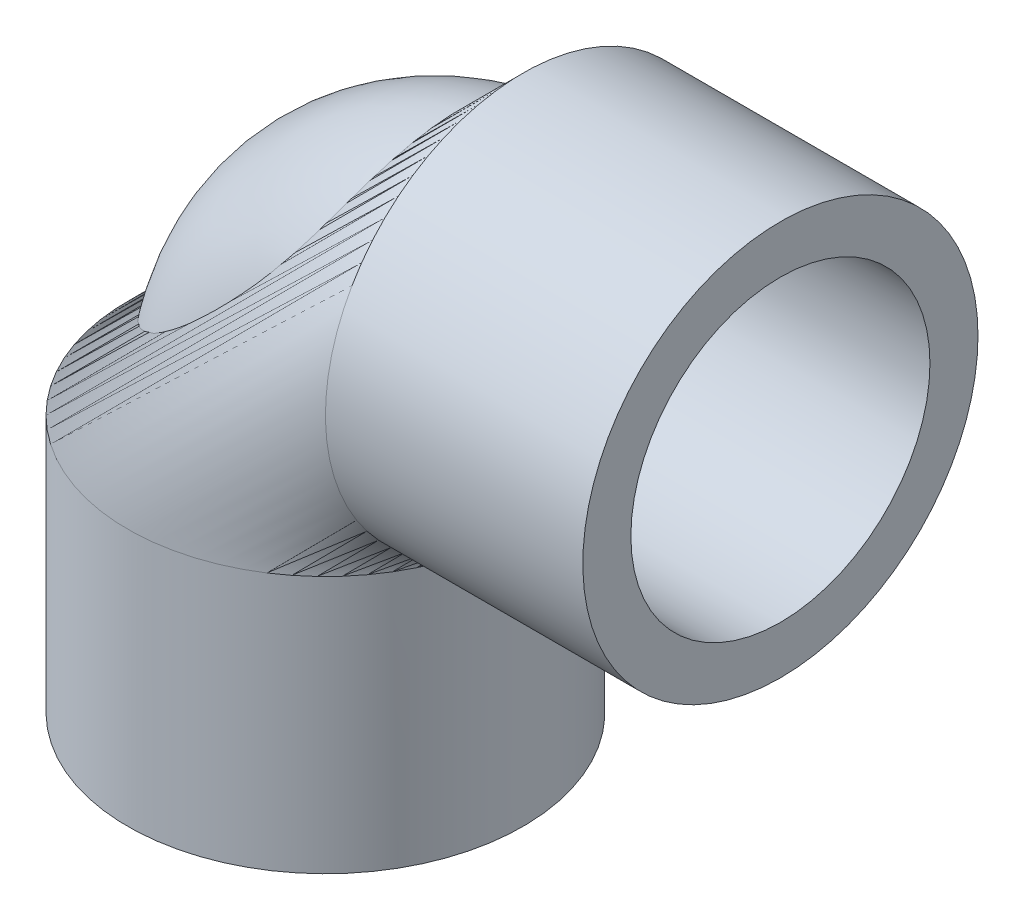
ISO-10303-21;
HEADER;
FILE_DESCRIPTION(('STEP AP214'),'2;1');
FILE_NAME('part.step','',(''),(''),'','','');
FILE_SCHEMA(('AUTOMOTIVE_DESIGN { 1 0 10303 214 1 1 1 1 }'));
ENDSEC;
DATA;
#1=APPLICATION_CONTEXT('core data for automotive mechanical design processes');
#2=APPLICATION_PROTOCOL_DEFINITION('international standard','automotive_design',2000,#1);
#3=PRODUCT_CONTEXT('',#1,'mechanical');
#4=PRODUCT('Part','Part','',(#3));
#5=PRODUCT_RELATED_PRODUCT_CATEGORY('part','',(#4));
#6=PRODUCT_DEFINITION_FORMATION('','',#4);
#7=PRODUCT_DEFINITION_CONTEXT('part definition',#1,'design');
#8=PRODUCT_DEFINITION('design','',#6,#7);
#9=PRODUCT_DEFINITION_SHAPE('','',#8);
#10=(LENGTH_UNIT() NAMED_UNIT(*) SI_UNIT(.MILLI.,.METRE.));
#11=(NAMED_UNIT(*) PLANE_ANGLE_UNIT() SI_UNIT($,.RADIAN.));
#12=(NAMED_UNIT(*) SI_UNIT($,.STERADIAN.) SOLID_ANGLE_UNIT());
#13=UNCERTAINTY_MEASURE_WITH_UNIT(LENGTH_MEASURE(1.E-05),#10,'distance_accuracy_value','');
#14=(GEOMETRIC_REPRESENTATION_CONTEXT(3) GLOBAL_UNCERTAINTY_ASSIGNED_CONTEXT((#13)) GLOBAL_UNIT_ASSIGNED_CONTEXT((#10,
#11,#12)) REPRESENTATION_CONTEXT('',''));
#15=CARTESIAN_POINT('',(0.,0.,0.));
#16=DIRECTION('',(0.,0.,1.));
#17=DIRECTION('',(1.,0.,0.));
#18=AXIS2_PLACEMENT_3D('',#15,#16,#17);
#19=CARTESIAN_POINT('',(0.,0.,0.));
#20=DIRECTION('',(0.,0.,1.));
#21=DIRECTION('',(1.,0.,0.));
#22=AXIS2_PLACEMENT_3D('',#19,#20,#21);
#23=TOROIDAL_SURFACE('',#22,13.843,9.8425);
#24=CARTESIAN_POINT('',(-1.016,6.58581162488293,-6.73296011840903));
#25=CARTESIAN_POINT('',(-1.016,6.39251090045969,-6.52925816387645));
#26=CARTESIAN_POINT('',(-1.016,6.20780896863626,-6.31744033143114));
#27=CARTESIAN_POINT('',(-1.016,5.85681571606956,-5.87894812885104));
#28=CARTESIAN_POINT('',(-1.016,5.69052935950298,-5.65226977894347));
#29=CARTESIAN_POINT('',(-1.016,5.37751657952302,-5.18547416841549));
#30=CARTESIAN_POINT('',(-1.016,5.230809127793,-4.94534418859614));
#31=CARTESIAN_POINT('',(-1.016,4.95821737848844,-4.45339318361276));
#32=CARTESIAN_POINT('',(-1.016,4.83234262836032,-4.20156686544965));
#33=CARTESIAN_POINT('',(-1.016,4.60283813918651,-3.68870712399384));
#34=CARTESIAN_POINT('',(-1.016,4.49915484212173,-3.42769767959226));
#35=CARTESIAN_POINT('',(-1.016,4.31464924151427,-2.89785648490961));
#36=CARTESIAN_POINT('',(-1.016,4.23381573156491,-2.6290286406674));
#37=CARTESIAN_POINT('',(-1.016,4.09580245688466,-2.08546148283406));
#38=CARTESIAN_POINT('',(-1.016,4.03861446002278,-1.81072426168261));
#39=CARTESIAN_POINT('',(-1.016,3.94851266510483,-1.25729979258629));
#40=CARTESIAN_POINT('',(-1.016,3.91559797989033,-0.978612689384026));
#41=CARTESIAN_POINT('',(-1.016,3.87501943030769,-0.427147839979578));
#42=CARTESIAN_POINT('',(-1.016,3.86668344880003,-0.154419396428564));
#43=CARTESIAN_POINT('',(-1.016,3.87345090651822,0.39074380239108));
#44=CARTESIAN_POINT('',(-1.016,3.88855396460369,0.663178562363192));
#45=CARTESIAN_POINT('',(-1.016,3.94201643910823,1.20577776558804));
#46=CARTESIAN_POINT('',(-1.016,3.98037802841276,1.47594199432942));
#47=CARTESIAN_POINT('',(-1.016,4.07991386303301,2.01203176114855));
#48=CARTESIAN_POINT('',(-1.016,4.14108823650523,2.2779572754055));
#49=CARTESIAN_POINT('',(-1.016,4.28458411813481,2.80001991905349));
#50=CARTESIAN_POINT('',(-1.016,4.36659701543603,3.05624202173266));
#51=CARTESIAN_POINT('',(-1.016,4.55143932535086,3.56116568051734));
#52=CARTESIAN_POINT('',(-1.016,4.65427634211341,3.80986445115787));
#53=CARTESIAN_POINT('',(-1.016,4.87985704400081,4.29797036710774));
#54=CARTESIAN_POINT('',(-1.016,5.00259487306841,4.53738022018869));
#55=CARTESIAN_POINT('',(-1.016,5.26712454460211,5.00556934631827));
#56=CARTESIAN_POINT('',(-1.016,5.40892504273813,5.23434372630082));
#57=CARTESIAN_POINT('',(-1.016,5.71517932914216,5.68655345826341));
#58=CARTESIAN_POINT('',(-1.016,5.88019594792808,5.90960786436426));
#59=CARTESIAN_POINT('',(-1.016,6.2281052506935,6.34115077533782));
#60=CARTESIAN_POINT('',(-1.016,6.41099037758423,6.54964537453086));
#61=CARTESIAN_POINT('',(-1.016,6.7935049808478,6.95083368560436));
#62=CARTESIAN_POINT('',(-1.016,6.99314154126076,7.14352064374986));
#63=CARTESIAN_POINT('',(-1.016,7.40764263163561,7.51159133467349));
#64=CARTESIAN_POINT('',(-1.016,7.62250155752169,7.6869813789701));
#65=CARTESIAN_POINT('',(-1.016,8.06936209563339,8.02179590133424));
#66=CARTESIAN_POINT('',(-1.016,8.30157188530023,8.18094266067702));
#67=CARTESIAN_POINT('',(-1.016,8.77859906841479,8.47906910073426));
#68=CARTESIAN_POINT('',(-1.016,9.02341661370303,8.61804853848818));
#69=CARTESIAN_POINT('',(-1.016,9.52393091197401,8.8748164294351));
#70=CARTESIAN_POINT('',(-1.016,9.77962789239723,8.9926044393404));
#71=CARTESIAN_POINT('',(-1.016,10.3000766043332,9.20610672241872));
#72=CARTESIAN_POINT('',(-1.016,10.5648282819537,9.30182112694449));
#73=CARTESIAN_POINT('',(-1.016,11.1006030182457,9.47017484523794));
#74=CARTESIAN_POINT('',(-1.016,11.3716023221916,9.54288975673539));
#75=CARTESIAN_POINT('',(-1.016,11.9187836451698,9.66512345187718));
#76=CARTESIAN_POINT('',(-1.016,12.1949656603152,9.71464225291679));
#77=CARTESIAN_POINT('',(-1.016,12.7505260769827,9.79009760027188));
#78=CARTESIAN_POINT('',(-1.016,13.0299043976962,9.81603474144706));
#79=CARTESIAN_POINT('',(-1.016,13.5898543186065,9.84411538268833));
#80=CARTESIAN_POINT('',(-1.016,13.8704259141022,9.84625897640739));
#81=CARTESIAN_POINT('',(-1.016,14.4291748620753,9.82676828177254));
#82=CARTESIAN_POINT('',(-1.016,14.7073568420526,9.80526649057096));
#83=CARTESIAN_POINT('',(-1.016,15.26090826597,9.73882894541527));
#84=CARTESIAN_POINT('',(-1.016,15.5362777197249,9.69389327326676));
#85=CARTESIAN_POINT('',(-1.016,16.0822252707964,9.58089281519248));
#86=CARTESIAN_POINT('',(-1.016,16.352803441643,9.51282838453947));
#87=CARTESIAN_POINT('',(-1.016,16.8872284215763,9.35404297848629));
#88=CARTESIAN_POINT('',(-1.016,17.1510752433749,9.26332204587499));
#89=CARTESIAN_POINT('',(-1.016,17.6691466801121,9.06025098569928));
#90=CARTESIAN_POINT('',(-1.016,17.9234041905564,8.94798477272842));
#91=CARTESIAN_POINT('',(-1.016,18.4215359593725,8.70239238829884));
#92=CARTESIAN_POINT('',(-1.016,18.6654102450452,8.56906627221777));
#93=CARTESIAN_POINT('',(-1.016,19.1410271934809,8.28229831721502));
#94=CARTESIAN_POINT('',(-1.016,19.3727699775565,8.12885667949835));
#95=CARTESIAN_POINT('',(-1.016,19.8224655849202,7.80294559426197));
#96=CARTESIAN_POINT('',(-1.016,20.0404184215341,7.63047616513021));
#97=CARTESIAN_POINT('',(-1.016,20.4604954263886,7.26814685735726));
#98=CARTESIAN_POINT('',(-1.016,20.6626542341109,7.07832713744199));
#99=CARTESIAN_POINT('',(-1.016,21.0502432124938,6.68231500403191));
#100=CARTESIAN_POINT('',(-1.016,21.235673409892,6.47612261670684));
#101=CARTESIAN_POINT('',(-1.016,21.5884785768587,6.04883193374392));
#102=CARTESIAN_POINT('',(-1.016,21.7558536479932,5.82773372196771));
#103=CARTESIAN_POINT('',(-1.016,22.0713525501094,5.37220382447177));
#104=CARTESIAN_POINT('',(-1.016,22.2194763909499,5.13777214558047));
#105=CARTESIAN_POINT('',(-1.016,22.4952369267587,4.65755185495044));
#106=CARTESIAN_POINT('',(-1.016,22.6228994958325,4.41177810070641));
#107=CARTESIAN_POINT('',(-1.016,22.8570537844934,3.91034452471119));
#108=CARTESIAN_POINT('',(-1.016,22.9635455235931,3.65468471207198));
#109=CARTESIAN_POINT('',(-1.016,23.1545973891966,3.13529867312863));
#110=CARTESIAN_POINT('',(-1.016,23.2391575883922,2.87157247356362));
#111=CARTESIAN_POINT('',(-1.016,23.3857428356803,2.3379298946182));
#112=CARTESIAN_POINT('',(-1.016,23.447767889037,2.06801351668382));
#113=CARTESIAN_POINT('',(-1.016,23.5488065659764,1.52409108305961));
#114=CARTESIAN_POINT('',(-1.016,23.5878352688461,1.25008782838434));
#115=CARTESIAN_POINT('',(-1.016,23.6426661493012,0.699767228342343));
#116=CARTESIAN_POINT('',(-1.016,23.6584683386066,0.423449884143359));
#117=CARTESIAN_POINT('',(-1.016,23.6667334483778,-0.129533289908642));
#118=CARTESIAN_POINT('',(-1.016,23.6591963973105,-0.406199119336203));
#119=CARTESIAN_POINT('',(-1.016,23.6208368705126,-0.957911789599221));
#120=CARTESIAN_POINT('',(-1.016,23.5900143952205,-1.23295863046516));
#121=CARTESIAN_POINT('',(-1.016,23.5053132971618,-1.77941690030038));
#122=CARTESIAN_POINT('',(-1.016,23.4514397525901,-2.05082911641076));
#123=CARTESIAN_POINT('',(-1.016,23.3210215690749,-2.58815074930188));
#124=CARTESIAN_POINT('',(-1.016,23.2444769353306,-2.85406016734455));
#125=CARTESIAN_POINT('',(-1.016,23.0692625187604,-3.37848635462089));
#126=CARTESIAN_POINT('',(-1.016,22.9705927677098,-3.63700313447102));
#127=CARTESIAN_POINT('',(-1.016,22.7518315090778,-4.14480821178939));
#128=CARTESIAN_POINT('',(-1.016,22.6317399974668,-4.39409650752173));
#129=CARTESIAN_POINT('',(-1.016,22.370970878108,-4.88171278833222));
#130=CARTESIAN_POINT('',(-1.016,22.230290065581,-5.1200390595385));
#131=CARTESIAN_POINT('',(-1.016,21.9293590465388,-5.58399843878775));
#132=CARTESIAN_POINT('',(-1.016,21.7691088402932,-5.80963154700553));
#133=CARTESIAN_POINT('',(-1.016,21.4301805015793,-6.24660516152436));
#134=CARTESIAN_POINT('',(-1.016,21.2515023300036,-6.45794563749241));
#135=CARTESIAN_POINT('',(-1.016,20.8769909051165,-6.86483655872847));
#136=CARTESIAN_POINT('',(-1.016,20.6811576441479,-7.0603869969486));
#137=CARTESIAN_POINT('',(-1.016,20.2736135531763,-7.43442153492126));
#138=CARTESIAN_POINT('',(-1.016,20.0618937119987,-7.6128958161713));
#139=CARTESIAN_POINT('',(-1.016,19.6241828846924,-7.95138983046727));
#140=CARTESIAN_POINT('',(-1.016,19.3981918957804,-8.11140955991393));
#141=CARTESIAN_POINT('',(-1.016,18.933546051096,-8.41186666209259));
#142=CARTESIAN_POINT('',(-1.016,18.6948911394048,-8.55230394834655));
#143=CARTESIAN_POINT('',(-1.016,18.2066152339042,-8.81260811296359));
#144=CARTESIAN_POINT('',(-1.016,17.9569942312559,-8.93247497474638));
#145=CARTESIAN_POINT('',(-1.016,17.4482622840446,-9.15092669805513));
#146=CARTESIAN_POINT('',(-1.016,17.1891406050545,-9.24948656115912));
#147=CARTESIAN_POINT('',(-1.016,16.6635251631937,-9.42445976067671));
#148=CARTESIAN_POINT('',(-1.016,16.3970313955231,-9.50087308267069));
#149=CARTESIAN_POINT('',(-1.016,15.8585738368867,-9.63102360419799));
#150=CARTESIAN_POINT('',(-1.016,15.5866102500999,-9.68476164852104));
#151=CARTESIAN_POINT('',(-1.016,15.0391307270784,-9.76920214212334));
#152=CARTESIAN_POINT('',(-1.016,14.7636147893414,-9.79990458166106));
#153=CARTESIAN_POINT('',(-1.016,14.2104421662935,-9.83811306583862));
#154=CARTESIAN_POINT('',(-1.016,13.9327823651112,-9.84557399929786));
#155=CARTESIAN_POINT('',(-1.016,13.3778171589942,-9.83714121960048));
#156=CARTESIAN_POINT('',(-1.016,13.1005117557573,-9.82124739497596));
#157=CARTESIAN_POINT('',(-1.016,12.5481410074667,-9.76623457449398));
#158=CARTESIAN_POINT('',(-1.016,12.2730762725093,-9.72710945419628));
#159=CARTESIAN_POINT('',(-1.016,11.7272010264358,-9.62593325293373));
#160=CARTESIAN_POINT('',(-1.016,11.456390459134,-9.56388247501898));
#161=CARTESIAN_POINT('',(-1.016,10.919855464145,-9.41703009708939));
#162=CARTESIAN_POINT('',(-1.016,10.6541554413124,-9.33213932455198));
#163=CARTESIAN_POINT('',(-1.016,10.1308198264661,-9.14035161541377));
#164=CARTESIAN_POINT('',(-1.016,9.87318430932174,-9.03345447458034));
#165=CARTESIAN_POINT('',(-1.016,9.36804427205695,-8.79856089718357));
#166=CARTESIAN_POINT('',(-1.016,9.12052937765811,-8.6705867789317));
#167=CARTESIAN_POINT('',(-1.016,8.63714213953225,-8.39443951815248));
#168=CARTESIAN_POINT('',(-1.016,8.40126682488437,-8.2462715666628));
#169=CARTESIAN_POINT('',(-1.016,7.8849891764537,-7.89104255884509));
#170=CARTESIAN_POINT('',(-1.016,7.60830758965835,-7.67854176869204));
#171=CARTESIAN_POINT('',(-1.016,7.07861044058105,-7.22584380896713));
#172=CARTESIAN_POINT('',(-1.016,6.82559527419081,-6.9856461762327));
#173=CARTESIAN_POINT('',(-1.016,6.58581162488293,-6.73296011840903));
#174=B_SPLINE_CURVE_WITH_KNOTS('',3,(#24,#25,#26,#27,#28,#29,#30,#31,#32,#33,#34,#35,#36,#37,
#38,#39,#40,#41,#42,#43,#44,#45,#46,#47,#48,#49,#50,#51,#52,#53,#54,#55,#56,#57,#58,#59,#60,#61,
#62,#63,#64,#65,#66,#67,#68,#69,#70,#71,#72,#73,#74,#75,#76,#77,#78,#79,#80,#81,#82,#83,#84,#85,
#86,#87,#88,#89,#90,#91,#92,#93,#94,#95,#96,#97,#98,#99,#100,#101,#102,#103,#104,#105,#106,#107,
#108,#109,#110,#111,#112,#113,#114,#115,#116,#117,#118,#119,#120,#121,#122,#123,#124,#125,#126,
#127,#128,#129,#130,#131,#132,#133,#134,#135,#136,#137,#138,#139,#140,#141,#142,#143,#144,#145,
#146,#147,#148,#149,#150,#151,#152,#153,#154,#155,#156,#157,#158,#159,#160,#161,#162,#163,#164,
#165,#166,#167,#168,#169,#170,#171,#172,#173),.UNSPECIFIED.,.T.,.F.,(4,2,2,2,2,2,2,2,2,2,2,2,2,
2,2,2,2,2,2,2,2,2,2,2,2,2,2,2,2,2,2,2,2,2,2,2,2,2,2,2,2,2,2,2,2,2,2,2,2,2,2,2,2,2,2,2,2,2,2,2,2,
2,2,2,2,2,2,2,2,2,2,2,2,2,4),(0.,0.842155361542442,1.68453718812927,2.52772943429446,
3.3713070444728,4.21282517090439,5.05392986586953,5.89474148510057,6.73552237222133,
7.55308810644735,8.37064054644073,9.18826937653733,10.0059027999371,10.8120692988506,
11.6185307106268,12.4247552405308,13.2313470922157,14.0627603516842,14.893823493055,
15.7252398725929,16.5563517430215,17.3998822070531,18.2434228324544,19.0869811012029,
19.9305343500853,20.771285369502,21.6120357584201,22.4527649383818,23.2934908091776,
24.1295295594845,24.9655653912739,25.8015883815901,26.6376097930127,27.4704388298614,
28.3032656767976,29.13608419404,29.9689019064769,30.7998385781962,31.6307739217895,
32.4617045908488,33.29263483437,34.1225058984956,34.9523761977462,35.7822437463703,
36.6121111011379,37.4414336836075,38.2707558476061,39.1000770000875,39.9293981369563,
40.7585366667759,41.5876750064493,42.4168121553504,43.2459494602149,44.0752159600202,
44.9044824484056,45.7337506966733,46.5630193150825,47.3927619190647,48.2225046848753,
49.0522511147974,49.8819982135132,50.7127135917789,51.5434295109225,52.3741144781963,
53.2047997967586,54.0370964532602,54.8693970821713,55.7019172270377,56.5344263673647,
57.3702342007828,58.2060497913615,59.0409859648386,59.8757079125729,60.9203584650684,
61.965026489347),.UNSPECIFIED.);
#175=CARTESIAN_POINT('',(-1.016,6.58581162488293,-6.73296011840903));
#176=VERTEX_POINT('',#175);
#177=EDGE_CURVE('E62',#176,#176,#174,.T.);
#178=ORIENTED_EDGE('',*,*,#177,.F.);
#179=EDGE_LOOP('',(#178));
#180=FACE_BOUND('',#179,.T.);
#181=CARTESIAN_POINT('',(-20.7522397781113,1.016,-6.98520730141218));
#182=CARTESIAN_POINT('',(-20.9485328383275,1.016,-6.79058651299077));
#183=CARTESIAN_POINT('',(-21.1365992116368,1.016,-6.58771530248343));
#184=CARTESIAN_POINT('',(-21.495053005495,1.016,-6.16679939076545));
#185=CARTESIAN_POINT('',(-21.6654357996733,1.016,-5.94875074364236));
#186=CARTESIAN_POINT('',(-21.9874057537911,1.016,-5.49884774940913));
#187=CARTESIAN_POINT('',(-22.1389728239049,1.016,-5.26697903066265));
#188=CARTESIAN_POINT('',(-22.4220255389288,1.016,-4.79128547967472));
#189=CARTESIAN_POINT('',(-22.5535108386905,1.016,-4.54746044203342));
#190=CARTESIAN_POINT('',(-22.7953998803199,1.016,-4.04970977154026));
#191=CARTESIAN_POINT('',(-22.9058134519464,1.016,-3.79578891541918));
#192=CARTESIAN_POINT('',(-23.1048491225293,1.016,-3.27954077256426));
#193=CARTESIAN_POINT('',(-23.1934708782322,1.016,-3.01721335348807));
#194=CARTESIAN_POINT('',(-23.3482688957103,1.016,-2.48608715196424));
#195=CARTESIAN_POINT('',(-23.4144506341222,1.016,-2.21728996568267));
#196=CARTESIAN_POINT('',(-23.5239249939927,1.016,-1.67508021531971));
#197=CARTESIAN_POINT('',(-23.5672181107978,1.016,-1.40166775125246));
#198=CARTESIAN_POINT('',(-23.6305995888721,1.016,-0.852243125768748));
#199=CARTESIAN_POINT('',(-23.6506943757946,1.016,-0.576231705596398));
#200=CARTESIAN_POINT('',(-23.6675574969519,1.016,-0.0234969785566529));
#201=CARTESIAN_POINT('',(-23.6643258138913,1.016,0.253226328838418));
#202=CARTESIAN_POINT('',(-23.6345584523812,1.016,0.805426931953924));
#203=CARTESIAN_POINT('',(-23.6080219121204,1.016,1.08090418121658));
#204=CARTESIAN_POINT('',(-23.5318329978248,1.016,1.62864325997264));
#205=CARTESIAN_POINT('',(-23.4821806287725,1.016,1.90090509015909));
#206=CARTESIAN_POINT('',(-23.3601241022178,1.016,2.44023415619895));
#207=CARTESIAN_POINT('',(-23.2877235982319,1.016,2.70730221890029));
#208=CARTESIAN_POINT('',(-23.1206846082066,1.016,3.23439084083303));
#209=CARTESIAN_POINT('',(-23.0260461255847,1.016,3.49441140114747));
#210=CARTESIAN_POINT('',(-22.8152061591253,1.016,4.00555737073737));
#211=CARTESIAN_POINT('',(-22.6990047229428,1.016,4.2566827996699));
#212=CARTESIAN_POINT('',(-22.4458670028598,1.016,4.74825611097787));
#213=CARTESIAN_POINT('',(-22.308930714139,1.016,4.98870399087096));
#214=CARTESIAN_POINT('',(-22.0152643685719,1.016,5.45727146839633));
#215=CARTESIAN_POINT('',(-21.8585296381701,1.016,5.68538813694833));
#216=CARTESIAN_POINT('',(-21.5264088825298,1.016,6.12761377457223));
#217=CARTESIAN_POINT('',(-21.3510228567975,1.016,6.34172274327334));
#218=CARTESIAN_POINT('',(-20.9828491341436,1.016,6.75441565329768));
#219=CARTESIAN_POINT('',(-20.7900614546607,1.016,6.9529996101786));
#220=CARTESIAN_POINT('',(-20.3884569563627,1.016,7.33323752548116));
#221=CARTESIAN_POINT('',(-20.1796401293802,1.016,7.51489147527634));
#222=CARTESIAN_POINT('',(-19.7473175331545,1.016,7.86010241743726));
#223=CARTESIAN_POINT('',(-19.5238019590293,1.016,8.0236471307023));
#224=CARTESIAN_POINT('',(-19.0637995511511,1.016,8.33134429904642));
#225=CARTESIAN_POINT('',(-18.8273127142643,1.016,8.47549674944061));
#226=CARTESIAN_POINT('',(-18.3430494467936,1.016,8.74339538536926));
#227=CARTESIAN_POINT('',(-18.0952729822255,1.016,8.86714150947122));
#228=CARTESIAN_POINT('',(-17.5901919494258,1.016,9.09335978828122));
#229=CARTESIAN_POINT('',(-17.3328873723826,1.016,9.1958319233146));
#230=CARTESIAN_POINT('',(-16.8102372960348,1.016,9.37890706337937));
#231=CARTESIAN_POINT('',(-16.5448817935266,1.016,9.45948151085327));
#232=CARTESIAN_POINT('',(-16.0083347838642,1.016,9.59802776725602));
#233=CARTESIAN_POINT('',(-15.7371432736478,1.016,9.65599956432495));
#234=CARTESIAN_POINT('',(-15.1908471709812,1.016,9.74894626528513));
#235=CARTESIAN_POINT('',(-14.9157425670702,1.016,9.78392110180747));
#236=CARTESIAN_POINT('',(-14.3635683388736,1.016,9.8306450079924));
#237=CARTESIAN_POINT('',(-14.0864987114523,1.016,9.84239404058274));
#238=CARTESIAN_POINT('',(-13.5317166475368,1.016,9.84260477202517));
#239=CARTESIAN_POINT('',(-13.2540041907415,1.016,9.83101312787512));
#240=CARTESIAN_POINT('',(-12.7005352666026,1.016,9.78454175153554));
#241=CARTESIAN_POINT('',(-12.4247788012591,1.016,9.74966199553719));
#242=CARTESIAN_POINT('',(-11.8771624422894,1.016,9.65688707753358));
#243=CARTESIAN_POINT('',(-11.6053025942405,1.016,9.59899164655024));
#244=CARTESIAN_POINT('',(-11.0673912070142,1.016,9.46062264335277));
#245=CARTESIAN_POINT('',(-10.8013396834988,1.016,9.38014901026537));
#246=CARTESIAN_POINT('',(-10.2758925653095,1.016,9.19686707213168));
#247=CARTESIAN_POINT('',(-10.0165266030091,1.016,9.09397381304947));
#248=CARTESIAN_POINT('',(-9.50733994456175,1.016,8.8667947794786));
#249=CARTESIAN_POINT('',(-9.25751926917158,1.016,8.74250895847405));
#250=CARTESIAN_POINT('',(-8.76920822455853,1.016,8.47347547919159));
#251=CARTESIAN_POINT('',(-8.53071587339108,1.016,8.32873141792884));
#252=CARTESIAN_POINT('',(-8.06658371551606,1.016,8.01975298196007));
#253=CARTESIAN_POINT('',(-7.8409486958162,1.016,7.85551141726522));
#254=CARTESIAN_POINT('',(-7.40300971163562,1.016,7.50781821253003));
#255=CARTESIAN_POINT('',(-7.19078417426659,1.016,7.3242677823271));
#256=CARTESIAN_POINT('',(-6.78248018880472,1.016,6.94000035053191));
#257=CARTESIAN_POINT('',(-6.58640215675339,1.016,6.7392829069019));
#258=CARTESIAN_POINT('',(-6.21175494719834,1.016,6.32207140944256));
#259=CARTESIAN_POINT('',(-6.03318824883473,1.016,6.10557512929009));
#260=CARTESIAN_POINT('',(-5.69487878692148,1.016,5.65834145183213));
#261=CARTESIAN_POINT('',(-5.53513604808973,1.016,5.42760403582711));
#262=CARTESIAN_POINT('',(-5.23515297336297,1.016,4.95267269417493));
#263=CARTESIAN_POINT('',(-5.09498117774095,1.016,4.70843546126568));
#264=CARTESIAN_POINT('',(-4.83591127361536,1.016,4.20893508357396));
#265=CARTESIAN_POINT('',(-4.71701232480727,1.016,3.95367237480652));
#266=CARTESIAN_POINT('',(-4.50150776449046,1.016,3.43388573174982));
#267=CARTESIAN_POINT('',(-4.40490304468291,1.016,3.16936142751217));
#268=CARTESIAN_POINT('',(-4.23495968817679,1.016,2.63305422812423));
#269=CARTESIAN_POINT('',(-4.16161140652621,1.016,2.36127439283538));
#270=CARTESIAN_POINT('',(-4.03990379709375,1.016,1.81675331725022));
#271=CARTESIAN_POINT('',(-3.99116223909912,1.016,1.54409754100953));
#272=CARTESIAN_POINT('',(-3.91748209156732,1.016,0.99558657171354));
#273=CARTESIAN_POINT('',(-3.89254312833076,1.016,0.719731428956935));
#274=CARTESIAN_POINT('',(-3.86677985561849,1.016,0.16695119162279));
#275=CARTESIAN_POINT('',(-3.8659507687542,1.016,-0.109973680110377));
#276=CARTESIAN_POINT('',(-3.88840613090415,1.016,-0.662840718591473));
#277=CARTESIAN_POINT('',(-3.91169022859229,1.016,-0.938782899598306));
#278=CARTESIAN_POINT('',(-3.98103409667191,1.016,-1.47945648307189));
#279=CARTESIAN_POINT('',(-4.0263975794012,1.016,-1.74427758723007));
#280=CARTESIAN_POINT('',(-4.13907459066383,1.016,-2.26930624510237));
#281=CARTESIAN_POINT('',(-4.20639616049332,1.016,-2.52951207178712));
#282=CARTESIAN_POINT('',(-4.36229632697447,1.016,-3.04340718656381));
#283=CARTESIAN_POINT('',(-4.45087028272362,1.016,-3.29709788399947));
#284=CARTESIAN_POINT('',(-4.64853516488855,1.016,-3.79648403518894));
#285=CARTESIAN_POINT('',(-4.75763546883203,1.016,-4.04217577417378));
#286=CARTESIAN_POINT('',(-4.99757968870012,1.016,-4.52819284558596));
#287=CARTESIAN_POINT('',(-5.1287781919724,1.016,-4.76834313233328));
#288=CARTESIAN_POINT('',(-5.4104299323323,1.016,-5.23693089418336));
#289=CARTESIAN_POINT('',(-5.56087503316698,1.016,-5.4653732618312));
#290=CARTESIAN_POINT('',(-5.88004999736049,1.016,-5.90924870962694));
#291=CARTESIAN_POINT('',(-6.04878740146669,1.016,-6.12467636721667));
#292=CARTESIAN_POINT('',(-6.40326828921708,1.016,-6.54091989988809));
#293=CARTESIAN_POINT('',(-6.58900580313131,1.016,-6.74174086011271));
#294=CARTESIAN_POINT('',(-6.98136197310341,1.016,-7.13256758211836));
#295=CARTESIAN_POINT('',(-7.18839994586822,1.016,-7.32215265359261));
#296=CARTESIAN_POINT('',(-7.61767197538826,1.016,-7.68326414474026));
#297=CARTESIAN_POINT('',(-7.83990630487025,1.016,-7.85479024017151));
#298=CARTESIAN_POINT('',(-8.29802316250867,1.016,-8.17855331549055));
#299=CARTESIAN_POINT('',(-8.53390625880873,1.016,-8.33078949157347));
#300=CARTESIAN_POINT('',(-9.01765549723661,1.016,-8.61485432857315));
#301=CARTESIAN_POINT('',(-9.26552158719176,1.016,-8.74668307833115));
#302=CARTESIAN_POINT('',(-9.77192599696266,1.016,-8.98917159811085));
#303=CARTESIAN_POINT('',(-10.0304819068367,1.016,-9.09979463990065));
#304=CARTESIAN_POINT('',(-10.5560295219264,1.016,-9.29876419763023));
#305=CARTESIAN_POINT('',(-10.8230212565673,1.016,-9.3871106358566));
#306=CARTESIAN_POINT('',(-11.3635173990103,1.016,-9.54085456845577));
#307=CARTESIAN_POINT('',(-11.6370214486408,1.016,-9.60625332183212));
#308=CARTESIAN_POINT('',(-12.1885922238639,1.016,-9.71360592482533));
#309=CARTESIAN_POINT('',(-12.4666589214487,1.016,-9.75555991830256));
#310=CARTESIAN_POINT('',(-13.0237379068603,1.016,-9.81551832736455));
#311=CARTESIAN_POINT('',(-13.3027354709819,1.016,-9.83365959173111));
#312=CARTESIAN_POINT('',(-13.8612710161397,1.016,-9.84628506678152));
#313=CARTESIAN_POINT('',(-14.1408090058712,1.016,-9.8407688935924));
#314=CARTESIAN_POINT('',(-14.6984790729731,1.016,-9.80609150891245));
#315=CARTESIAN_POINT('',(-14.9766108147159,1.016,-9.77692489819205));
#316=CARTESIAN_POINT('',(-15.5293983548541,1.016,-9.6951303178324));
#317=CARTESIAN_POINT('',(-15.8040542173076,1.016,-9.64250278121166));
#318=CARTESIAN_POINT('',(-16.3467924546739,1.016,-9.51441298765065));
#319=CARTESIAN_POINT('',(-16.6148972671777,1.016,-9.43904579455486));
#320=CARTESIAN_POINT('',(-17.1437737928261,1.016,-9.26592897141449));
#321=CARTESIAN_POINT('',(-17.404545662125,1.016,-9.16817981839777));
#322=CARTESIAN_POINT('',(-17.9166182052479,1.016,-8.95109936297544));
#323=CARTESIAN_POINT('',(-18.1679288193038,1.016,-8.83179152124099));
#324=CARTESIAN_POINT('',(-18.6594921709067,1.016,-8.57241396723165));
#325=CARTESIAN_POINT('',(-18.899747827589,1.016,-8.43234977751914));
#326=CARTESIAN_POINT('',(-19.4252156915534,1.016,-8.09544592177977));
#327=CARTESIAN_POINT('',(-19.7069309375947,1.016,-7.89311842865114));
#328=CARTESIAN_POINT('',(-20.2474815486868,1.016,-7.45991297));
#329=CARTESIAN_POINT('',(-20.5063169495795,1.016,-7.22903504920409));
#330=CARTESIAN_POINT('',(-20.7522397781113,1.016,-6.98520730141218));
#331=B_SPLINE_CURVE_WITH_KNOTS('',3,(#181,#182,#183,#184,#185,#186,#187,#188,#189,#190,#191,
#192,#193,#194,#195,#196,#197,#198,#199,#200,#201,#202,#203,#204,#205,#206,#207,#208,#209,#210,
#211,#212,#213,#214,#215,#216,#217,#218,#219,#220,#221,#222,#223,#224,#225,#226,#227,#228,#229,
#230,#231,#232,#233,#234,#235,#236,#237,#238,#239,#240,#241,#242,#243,#244,#245,#246,#247,#248,
#249,#250,#251,#252,#253,#254,#255,#256,#257,#258,#259,#260,#261,#262,#263,#264,#265,#266,#267,
#268,#269,#270,#271,#272,#273,#274,#275,#276,#277,#278,#279,#280,#281,#282,#283,#284,#285,#286,
#287,#288,#289,#290,#291,#292,#293,#294,#295,#296,#297,#298,#299,#300,#301,#302,#303,#304,#305,
#306,#307,#308,#309,#310,#311,#312,#313,#314,#315,#316,#317,#318,#319,#320,#321,#322,#323,#324,
#325,#326,#327,#328,#329,#330),.UNSPECIFIED.,.T.,.F.,(4,2,2,2,2,2,2,2,2,2,2,2,2,2,2,2,2,2,2,2,2,
2,2,2,2,2,2,2,2,2,2,2,2,2,2,2,2,2,2,2,2,2,2,2,2,2,2,2,2,2,2,2,2,2,2,2,2,2,2,2,2,2,2,2,2,2,2,2,2,
2,2,2,2,2,4),(0.,0.828958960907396,1.65813424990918,2.4881873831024,3.31825478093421,
4.14793400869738,4.97762630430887,5.80711596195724,6.63658766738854,7.46582956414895,
8.29507207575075,9.12434525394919,9.95361825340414,10.7827581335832,11.61189788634,
12.4410358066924,13.2701739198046,14.0995081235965,14.928842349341,15.7581757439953,
16.587509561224,17.4174023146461,18.2472952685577,19.0771907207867,19.9070869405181,
20.7380603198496,21.5690341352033,22.4000103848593,23.230987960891,24.0638668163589,
24.8967465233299,25.7296359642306,26.5625276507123,27.3986320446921,28.2347382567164,
29.0706976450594,29.9069662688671,30.747743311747,31.5885420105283,32.4294595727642,
33.2703782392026,34.11417177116,34.9579319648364,35.8017259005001,36.6451694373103,
37.4750737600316,38.3049650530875,39.1346919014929,39.9644066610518,40.7695025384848,
41.5748935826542,42.3801089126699,43.1856930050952,44.0057121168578,44.8253857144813,
45.6453985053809,46.4651244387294,47.3063072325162,48.1475051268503,48.9887380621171,
49.8299673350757,50.6726407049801,51.5153170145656,52.3579470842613,53.2005719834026,
54.0383329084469,54.8761074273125,55.7140732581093,56.5520236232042,57.3865183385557,
58.2209952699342,59.054569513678,59.8879223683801,60.9264728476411,61.9650216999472),.UNSPECIFIED.);
#332=CARTESIAN_POINT('',(-20.7522397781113,1.016,-6.98520730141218));
#333=VERTEX_POINT('',#332);
#334=EDGE_CURVE('E42',#333,#333,#331,.T.);
#335=ORIENTED_EDGE('',*,*,#334,.F.);
#336=EDGE_LOOP('',(#335));
#337=FACE_BOUND('',#336,.T.);
#338=ADVANCED_FACE('F38',(#180,#337),#23,.F.);
#339=CARTESIAN_POINT('',(18.034,13.843,0.));
#340=DIRECTION('',(-1.,0.,0.));
#341=DIRECTION('',(0.,0.,1.));
#342=AXIS2_PLACEMENT_3D('',#339,#340,#341);
#343=CYLINDRICAL_SURFACE('',#342,13.843);
#344=CARTESIAN_POINT('',(0.,13.843,0.));
#345=DIRECTION('',(1.,0.,0.));
#346=DIRECTION('',(0.,0.,-1.));
#347=AXIS2_PLACEMENT_3D('',#344,#345,#346);
#348=CIRCLE('',#347,13.843);
#349=CARTESIAN_POINT('',(0.,0.,0.));
#350=VERTEX_POINT('',#349);
#351=EDGE_CURVE('E57',#350,#350,#348,.T.);
#352=ORIENTED_EDGE('',*,*,#351,.T.);
#353=EDGE_LOOP('',(#352));
#354=FACE_BOUND('',#353,.T.);
#355=CARTESIAN_POINT('',(18.034,13.843,0.));
#356=DIRECTION('',(1.,0.,0.));
#357=DIRECTION('',(0.,0.,-1.));
#358=AXIS2_PLACEMENT_3D('',#355,#356,#357);
#359=CIRCLE('',#358,13.843);
#360=CARTESIAN_POINT('',(18.034,13.843,-13.843));
#361=VERTEX_POINT('',#360);
#362=EDGE_CURVE('E51',#361,#361,#359,.T.);
#363=ORIENTED_EDGE('',*,*,#362,.F.);
#364=EDGE_LOOP('',(#363));
#365=FACE_BOUND('',#364,.T.);
#366=ADVANCED_FACE('F82',(#354,#365),#343,.T.);
#367=CARTESIAN_POINT('',(0.,0.,0.));
#368=DIRECTION('',(0.,0.,1.));
#369=DIRECTION('',(1.,0.,0.));
#370=AXIS2_PLACEMENT_3D('',#367,#368,#369);
#371=DEGENERATE_TOROIDAL_SURFACE('',#370,13.843,13.843,.T.);
#372=CARTESIAN_POINT('',(-13.843,0.,0.));
#373=DIRECTION('',(0.,1.,0.));
#374=DIRECTION('',(0.,0.,-1.));
#375=AXIS2_PLACEMENT_3D('',#372,#373,#374);
#376=CIRCLE('',#375,13.843);
#377=EDGE_CURVE('E60',#350,#350,#376,.T.);
#378=ORIENTED_EDGE('',*,*,#377,.T.);
#379=ORIENTED_EDGE('',*,*,#351,.F.);
#380=EDGE_LOOP('',(#378,#379));
#381=FACE_BOUND('',#380,.T.);
#382=ADVANCED_FACE('F58',(#381),#371,.T.);
#383=CARTESIAN_POINT('',(-13.843,0.,0.));
#384=DIRECTION('',(0.,-1.,0.));
#385=DIRECTION('',(0.,0.,-1.));
#386=AXIS2_PLACEMENT_3D('',#383,#384,#385);
#387=CYLINDRICAL_SURFACE('',#386,13.843);
#388=CARTESIAN_POINT('',(-13.843,-18.034,0.));
#389=DIRECTION('',(0.,1.,0.));
#390=DIRECTION('',(0.,0.,-1.));
#391=AXIS2_PLACEMENT_3D('',#388,#389,#390);
#392=CIRCLE('',#391,13.843);
#393=CARTESIAN_POINT('',(-13.843,-18.034,-13.843));
#394=VERTEX_POINT('',#393);
#395=EDGE_CURVE('E11',#394,#394,#392,.T.);
#396=ORIENTED_EDGE('',*,*,#395,.T.);
#397=EDGE_LOOP('',(#396));
#398=FACE_BOUND('',#397,.T.);
#399=ORIENTED_EDGE('',*,*,#377,.F.);
#400=EDGE_LOOP('',(#399));
#401=FACE_BOUND('',#400,.T.);
#402=ADVANCED_FACE('F40',(#398,#401),#387,.T.);
#403=CARTESIAN_POINT('',(18.034,13.843,0.));
#404=DIRECTION('',(1.,0.,0.));
#405=DIRECTION('',(0.,0.,-1.));
#406=AXIS2_PLACEMENT_3D('',#403,#404,#405);
#407=PLANE('',#406);
#408=CARTESIAN_POINT('',(18.034,13.843,0.));
#409=DIRECTION('',(1.,0.,0.));
#410=DIRECTION('',(0.,0.,-1.));
#411=AXIS2_PLACEMENT_3D('',#408,#409,#410);
#412=CIRCLE('',#411,10.4775);
#413=CARTESIAN_POINT('',(18.034,13.843,-10.4775));
#414=VERTEX_POINT('',#413);
#415=EDGE_CURVE('E171',#414,#414,#412,.T.);
#416=ORIENTED_EDGE('',*,*,#415,.F.);
#417=EDGE_LOOP('',(#416));
#418=FACE_BOUND('',#417,.T.);
#419=ORIENTED_EDGE('',*,*,#362,.T.);
#420=EDGE_LOOP('',(#419));
#421=FACE_BOUND('',#420,.T.);
#422=ADVANCED_FACE('F102',(#418,#421),#407,.T.);
#423=CARTESIAN_POINT('',(-13.843,-18.034,0.));
#424=DIRECTION('',(0.,1.,0.));
#425=DIRECTION('',(0.,0.,-1.));
#426=AXIS2_PLACEMENT_3D('',#423,#424,#425);
#427=PLANE('',#426);
#428=CARTESIAN_POINT('',(-13.843,-18.034,0.));
#429=DIRECTION('',(0.,-1.,0.));
#430=DIRECTION('',(0.,0.,-1.));
#431=AXIS2_PLACEMENT_3D('',#428,#429,#430);
#432=CIRCLE('',#431,10.4775);
#433=CARTESIAN_POINT('',(-13.843,-18.034,-10.4775));
#434=VERTEX_POINT('',#433);
#435=EDGE_CURVE('E165',#434,#434,#432,.T.);
#436=ORIENTED_EDGE('',*,*,#435,.F.);
#437=EDGE_LOOP('',(#436));
#438=FACE_BOUND('',#437,.T.);
#439=ORIENTED_EDGE('',*,*,#395,.F.);
#440=EDGE_LOOP('',(#439));
#441=FACE_BOUND('',#440,.T.);
#442=ADVANCED_FACE('F80',(#438,#441),#427,.F.);
#443=CARTESIAN_POINT('',(-1.016,13.843,0.));
#444=DIRECTION('',(1.,0.,0.));
#445=DIRECTION('',(0.,0.,-1.));
#446=AXIS2_PLACEMENT_3D('',#443,#444,#445);
#447=PLANE('',#446);
#448=CARTESIAN_POINT('',(-1.016,13.843,0.));
#449=DIRECTION('',(1.,0.,0.));
#450=DIRECTION('',(0.,0.,-1.));
#451=AXIS2_PLACEMENT_3D('',#448,#449,#450);
#452=CIRCLE('',#451,10.4775);
#453=CARTESIAN_POINT('',(-1.016,13.843,-10.4775));
#454=VERTEX_POINT('',#453);
#455=EDGE_CURVE('E66',#454,#454,#452,.T.);
#456=ORIENTED_EDGE('',*,*,#455,.T.);
#457=EDGE_LOOP('',(#456));
#458=FACE_BOUND('',#457,.T.);
#459=ORIENTED_EDGE('',*,*,#177,.T.);
#460=EDGE_LOOP('',(#459));
#461=FACE_BOUND('',#460,.T.);
#462=ADVANCED_FACE('F75',(#458,#461),#447,.T.);
#463=CARTESIAN_POINT('',(-1.016,13.843,0.));
#464=DIRECTION('',(1.,0.,0.));
#465=DIRECTION('',(0.,0.,-1.));
#466=AXIS2_PLACEMENT_3D('',#463,#464,#465);
#467=CYLINDRICAL_SURFACE('',#466,10.4775);
#468=CARTESIAN_POINT('',(-1.016,13.843,-10.4775));
#469=CARTESIAN_POINT('',(-0.817562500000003,13.843,-10.4775));
#470=CARTESIAN_POINT('',(-0.619125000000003,13.843,-10.4775));
#471=CARTESIAN_POINT('',(-0.222250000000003,13.843,-10.4775));
#472=CARTESIAN_POINT('',(-0.023812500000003,13.843,-10.4775));
#473=CARTESIAN_POINT('',(0.373062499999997,13.843,-10.4775));
#474=CARTESIAN_POINT('',(0.571499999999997,13.843,-10.4775));
#475=CARTESIAN_POINT('',(0.968374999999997,13.843,-10.4775));
#476=CARTESIAN_POINT('',(1.1668125,13.843,-10.4775));
#477=CARTESIAN_POINT('',(1.5636875,13.843,-10.4775));
#478=CARTESIAN_POINT('',(1.762125,13.843,-10.4775));
#479=CARTESIAN_POINT('',(2.159,13.843,-10.4775));
#480=CARTESIAN_POINT('',(2.3574375,13.843,-10.4775));
#481=CARTESIAN_POINT('',(2.7543125,13.843,-10.4775));
#482=CARTESIAN_POINT('',(2.95275,13.843,-10.4775));
#483=CARTESIAN_POINT('',(3.349625,13.843,-10.4775));
#484=CARTESIAN_POINT('',(3.5480625,13.843,-10.4775));
#485=CARTESIAN_POINT('',(3.9449375,13.843,-10.4775));
#486=CARTESIAN_POINT('',(4.143375,13.843,-10.4775));
#487=CARTESIAN_POINT('',(4.54025,13.843,-10.4775));
#488=CARTESIAN_POINT('',(4.7386875,13.843,-10.4775));
#489=CARTESIAN_POINT('',(5.1355625,13.843,-10.4775));
#490=CARTESIAN_POINT('',(5.334,13.843,-10.4775));
#491=CARTESIAN_POINT('',(5.730875,13.843,-10.4775));
#492=CARTESIAN_POINT('',(5.9293125,13.843,-10.4775));
#493=CARTESIAN_POINT('',(6.3261875,13.843,-10.4775));
#494=CARTESIAN_POINT('',(6.524625,13.843,-10.4775));
#495=CARTESIAN_POINT('',(6.9215,13.843,-10.4775));
#496=CARTESIAN_POINT('',(7.1199375,13.843,-10.4775));
#497=CARTESIAN_POINT('',(7.5168125,13.843,-10.4775));
#498=CARTESIAN_POINT('',(7.71525,13.843,-10.4775));
#499=CARTESIAN_POINT('',(8.112125,13.843,-10.4775));
#500=CARTESIAN_POINT('',(8.3105625,13.843,-10.4775));
#501=CARTESIAN_POINT('',(8.7074375,13.843,-10.4775));
#502=CARTESIAN_POINT('',(8.905875,13.843,-10.4775));
#503=CARTESIAN_POINT('',(9.30275,13.843,-10.4775));
#504=CARTESIAN_POINT('',(9.5011875,13.843,-10.4775));
#505=CARTESIAN_POINT('',(9.8980625,13.843,-10.4775));
#506=CARTESIAN_POINT('',(10.0965,13.843,-10.4775));
#507=CARTESIAN_POINT('',(10.493375,13.843,-10.4775));
#508=CARTESIAN_POINT('',(10.6918125,13.843,-10.4775));
#509=CARTESIAN_POINT('',(11.0886875,13.843,-10.4775));
#510=CARTESIAN_POINT('',(11.287125,13.843,-10.4775));
#511=CARTESIAN_POINT('',(11.684,13.843,-10.4775));
#512=CARTESIAN_POINT('',(11.8824375,13.843,-10.4775));
#513=CARTESIAN_POINT('',(12.2793125,13.843,-10.4775));
#514=CARTESIAN_POINT('',(12.47775,13.843,-10.4775));
#515=CARTESIAN_POINT('',(12.874625,13.843,-10.4775));
#516=CARTESIAN_POINT('',(13.0730625,13.843,-10.4775));
#517=CARTESIAN_POINT('',(13.4699375,13.843,-10.4775));
#518=CARTESIAN_POINT('',(13.668375,13.843,-10.4775));
#519=CARTESIAN_POINT('',(14.06525,13.843,-10.4775));
#520=CARTESIAN_POINT('',(14.2636875,13.843,-10.4775));
#521=CARTESIAN_POINT('',(14.6605625,13.843,-10.4775));
#522=CARTESIAN_POINT('',(14.859,13.843,-10.4775));
#523=CARTESIAN_POINT('',(15.255875,13.843,-10.4775));
#524=CARTESIAN_POINT('',(15.4543125,13.843,-10.4775));
#525=CARTESIAN_POINT('',(15.8511875,13.843,-10.4775));
#526=CARTESIAN_POINT('',(16.049625,13.843,-10.4775));
#527=CARTESIAN_POINT('',(16.4465,13.843,-10.4775));
#528=CARTESIAN_POINT('',(16.6449375,13.843,-10.4775));
#529=CARTESIAN_POINT('',(17.0418125,13.843,-10.4775));
#530=CARTESIAN_POINT('',(17.24025,13.843,-10.4775));
#531=CARTESIAN_POINT('',(17.637125,13.843,-10.4775));
#532=CARTESIAN_POINT('',(17.8355625,13.843,-10.4775));
#533=CARTESIAN_POINT('',(18.034,13.843,-10.4775));
#534=B_SPLINE_CURVE_WITH_KNOTS('',3,(#468,#469,#470,#471,#472,#473,#474,#475,#476,#477,#478,
#479,#480,#481,#482,#483,#484,#485,#486,#487,#488,#489,#490,#491,#492,#493,#494,#495,#496,#497,
#498,#499,#500,#501,#502,#503,#504,#505,#506,#507,#508,#509,#510,#511,#512,#513,#514,#515,#516,
#517,#518,#519,#520,#521,#522,#523,#524,#525,#526,#527,#528,#529,#530,#531,#532,#533),
.UNSPECIFIED.,.F.,.F.,(4,2,2,2,2,2,2,2,2,2,2,2,2,2,2,2,2,2,2,2,2,2,2,2,2,2,2,2,2,2,2,2,4),(0.,
0.5953125,1.190625,1.7859375,2.38125,2.9765625,3.571875,4.1671875,4.7625,5.3578125,5.953125,
6.5484375,7.14375,7.7390625,8.334375,8.9296875,9.525,10.1203125,10.715625,11.3109375,11.90625,
12.5015625,13.096875,13.6921875,14.2875,14.8828125,15.478125,16.0734375,16.66875,17.2640625,
17.859375,18.4546875,19.05),.UNSPECIFIED.);
#535=EDGE_CURVE('BSEAM79',#454,#414,#534,.T.);
#536=ORIENTED_EDGE('',*,*,#455,.F.);
#537=ORIENTED_EDGE('',*,*,#415,.T.);
#538=ORIENTED_EDGE('',*,*,#535,.T.);
#539=ORIENTED_EDGE('',*,*,#535,.F.);
#540=EDGE_LOOP('',(#536,#538,#537,#539));
#541=FACE_BOUND('',#540,.T.);
#542=ADVANCED_FACE('F79',(#541),#467,.F.);
#543=CARTESIAN_POINT('',(-13.843,1.016,0.));
#544=DIRECTION('',(0.,-1.,0.));
#545=DIRECTION('',(0.,0.,-1.));
#546=AXIS2_PLACEMENT_3D('',#543,#544,#545);
#547=PLANE('',#546);
#548=CARTESIAN_POINT('',(-13.843,1.016,0.));
#549=DIRECTION('',(0.,-1.,0.));
#550=DIRECTION('',(0.,0.,-1.));
#551=AXIS2_PLACEMENT_3D('',#548,#549,#550);
#552=CIRCLE('',#551,10.4775);
#553=CARTESIAN_POINT('',(-13.843,1.016,-10.4775));
#554=VERTEX_POINT('',#553);
#555=EDGE_CURVE('E163',#554,#554,#552,.T.);
#556=ORIENTED_EDGE('',*,*,#555,.T.);
#557=EDGE_LOOP('',(#556));
#558=FACE_BOUND('',#557,.T.);
#559=ORIENTED_EDGE('',*,*,#334,.T.);
#560=EDGE_LOOP('',(#559));
#561=FACE_BOUND('',#560,.T.);
#562=ADVANCED_FACE('F85',(#558,#561),#547,.T.);
#563=CARTESIAN_POINT('',(-13.843,1.016,0.));
#564=DIRECTION('',(0.,-1.,0.));
#565=DIRECTION('',(0.,0.,-1.));
#566=AXIS2_PLACEMENT_3D('',#563,#564,#565);
#567=CYLINDRICAL_SURFACE('',#566,10.4775);
#568=CARTESIAN_POINT('',(-13.843,1.016,-10.4775));
#569=CARTESIAN_POINT('',(-13.843,0.817562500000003,-10.4775));
#570=CARTESIAN_POINT('',(-13.843,0.619125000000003,-10.4775));
#571=CARTESIAN_POINT('',(-13.843,0.222250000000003,-10.4775));
#572=CARTESIAN_POINT('',(-13.843,0.023812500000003,-10.4775));
#573=CARTESIAN_POINT('',(-13.843,-0.373062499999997,-10.4775));
#574=CARTESIAN_POINT('',(-13.843,-0.571499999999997,-10.4775));
#575=CARTESIAN_POINT('',(-13.843,-0.968374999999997,-10.4775));
#576=CARTESIAN_POINT('',(-13.843,-1.1668125,-10.4775));
#577=CARTESIAN_POINT('',(-13.843,-1.5636875,-10.4775));
#578=CARTESIAN_POINT('',(-13.843,-1.762125,-10.4775));
#579=CARTESIAN_POINT('',(-13.843,-2.159,-10.4775));
#580=CARTESIAN_POINT('',(-13.843,-2.3574375,-10.4775));
#581=CARTESIAN_POINT('',(-13.843,-2.7543125,-10.4775));
#582=CARTESIAN_POINT('',(-13.843,-2.95275,-10.4775));
#583=CARTESIAN_POINT('',(-13.843,-3.349625,-10.4775));
#584=CARTESIAN_POINT('',(-13.843,-3.5480625,-10.4775));
#585=CARTESIAN_POINT('',(-13.843,-3.9449375,-10.4775));
#586=CARTESIAN_POINT('',(-13.843,-4.143375,-10.4775));
#587=CARTESIAN_POINT('',(-13.843,-4.54025,-10.4775));
#588=CARTESIAN_POINT('',(-13.843,-4.7386875,-10.4775));
#589=CARTESIAN_POINT('',(-13.843,-5.1355625,-10.4775));
#590=CARTESIAN_POINT('',(-13.843,-5.334,-10.4775));
#591=CARTESIAN_POINT('',(-13.843,-5.730875,-10.4775));
#592=CARTESIAN_POINT('',(-13.843,-5.9293125,-10.4775));
#593=CARTESIAN_POINT('',(-13.843,-6.3261875,-10.4775));
#594=CARTESIAN_POINT('',(-13.843,-6.524625,-10.4775));
#595=CARTESIAN_POINT('',(-13.843,-6.9215,-10.4775));
#596=CARTESIAN_POINT('',(-13.843,-7.1199375,-10.4775));
#597=CARTESIAN_POINT('',(-13.843,-7.5168125,-10.4775));
#598=CARTESIAN_POINT('',(-13.843,-7.71525,-10.4775));
#599=CARTESIAN_POINT('',(-13.843,-8.112125,-10.4775));
#600=CARTESIAN_POINT('',(-13.843,-8.3105625,-10.4775));
#601=CARTESIAN_POINT('',(-13.843,-8.7074375,-10.4775));
#602=CARTESIAN_POINT('',(-13.843,-8.905875,-10.4775));
#603=CARTESIAN_POINT('',(-13.843,-9.30275,-10.4775));
#604=CARTESIAN_POINT('',(-13.843,-9.5011875,-10.4775));
#605=CARTESIAN_POINT('',(-13.843,-9.8980625,-10.4775));
#606=CARTESIAN_POINT('',(-13.843,-10.0965,-10.4775));
#607=CARTESIAN_POINT('',(-13.843,-10.493375,-10.4775));
#608=CARTESIAN_POINT('',(-13.843,-10.6918125,-10.4775));
#609=CARTESIAN_POINT('',(-13.843,-11.0886875,-10.4775));
#610=CARTESIAN_POINT('',(-13.843,-11.287125,-10.4775));
#611=CARTESIAN_POINT('',(-13.843,-11.684,-10.4775));
#612=CARTESIAN_POINT('',(-13.843,-11.8824375,-10.4775));
#613=CARTESIAN_POINT('',(-13.843,-12.2793125,-10.4775));
#614=CARTESIAN_POINT('',(-13.843,-12.47775,-10.4775));
#615=CARTESIAN_POINT('',(-13.843,-12.874625,-10.4775));
#616=CARTESIAN_POINT('',(-13.843,-13.0730625,-10.4775));
#617=CARTESIAN_POINT('',(-13.843,-13.4699375,-10.4775));
#618=CARTESIAN_POINT('',(-13.843,-13.668375,-10.4775));
#619=CARTESIAN_POINT('',(-13.843,-14.06525,-10.4775));
#620=CARTESIAN_POINT('',(-13.843,-14.2636875,-10.4775));
#621=CARTESIAN_POINT('',(-13.843,-14.6605625,-10.4775));
#622=CARTESIAN_POINT('',(-13.843,-14.859,-10.4775));
#623=CARTESIAN_POINT('',(-13.843,-15.255875,-10.4775));
#624=CARTESIAN_POINT('',(-13.843,-15.4543125,-10.4775));
#625=CARTESIAN_POINT('',(-13.843,-15.8511875,-10.4775));
#626=CARTESIAN_POINT('',(-13.843,-16.049625,-10.4775));
#627=CARTESIAN_POINT('',(-13.843,-16.4465,-10.4775));
#628=CARTESIAN_POINT('',(-13.843,-16.6449375,-10.4775));
#629=CARTESIAN_POINT('',(-13.843,-17.0418125,-10.4775));
#630=CARTESIAN_POINT('',(-13.843,-17.24025,-10.4775));
#631=CARTESIAN_POINT('',(-13.843,-17.637125,-10.4775));
#632=CARTESIAN_POINT('',(-13.843,-17.8355625,-10.4775));
#633=CARTESIAN_POINT('',(-13.843,-18.034,-10.4775));
#634=B_SPLINE_CURVE_WITH_KNOTS('',3,(#568,#569,#570,#571,#572,#573,#574,#575,#576,#577,#578,
#579,#580,#581,#582,#583,#584,#585,#586,#587,#588,#589,#590,#591,#592,#593,#594,#595,#596,#597,
#598,#599,#600,#601,#602,#603,#604,#605,#606,#607,#608,#609,#610,#611,#612,#613,#614,#615,#616,
#617,#618,#619,#620,#621,#622,#623,#624,#625,#626,#627,#628,#629,#630,#631,#632,#633),
.UNSPECIFIED.,.F.,.F.,(4,2,2,2,2,2,2,2,2,2,2,2,2,2,2,2,2,2,2,2,2,2,2,2,2,2,2,2,2,2,2,2,4),(0.,
0.5953125,1.190625,1.7859375,2.38125,2.9765625,3.571875,4.1671875,4.7625,5.3578125,5.953125,
6.5484375,7.14375,7.7390625,8.334375,8.9296875,9.525,10.1203125,10.715625,11.3109375,11.90625,
12.5015625,13.096875,13.6921875,14.2875,14.8828125,15.478125,16.0734375,16.66875,17.2640625,
17.859375,18.4546875,19.05),.UNSPECIFIED.);
#635=EDGE_CURVE('BSEAM83',#554,#434,#634,.T.);
#636=ORIENTED_EDGE('',*,*,#555,.F.);
#637=ORIENTED_EDGE('',*,*,#435,.T.);
#638=ORIENTED_EDGE('',*,*,#635,.T.);
#639=ORIENTED_EDGE('',*,*,#635,.F.);
#640=EDGE_LOOP('',(#636,#638,#637,#639));
#641=FACE_BOUND('',#640,.T.);
#642=ADVANCED_FACE('F83',(#641),#567,.F.);
#643=CLOSED_SHELL('',(#338,#366,#382,#402,#422,#442,#462,#542,#562,#642));
#644=MANIFOLD_SOLID_BREP('B2',#643);
#645=ADVANCED_BREP_SHAPE_REPRESENTATION('',(#18,#644),#14);
#646=SHAPE_DEFINITION_REPRESENTATION(#9,#645);
ENDSEC;
END-ISO-10303-21;
